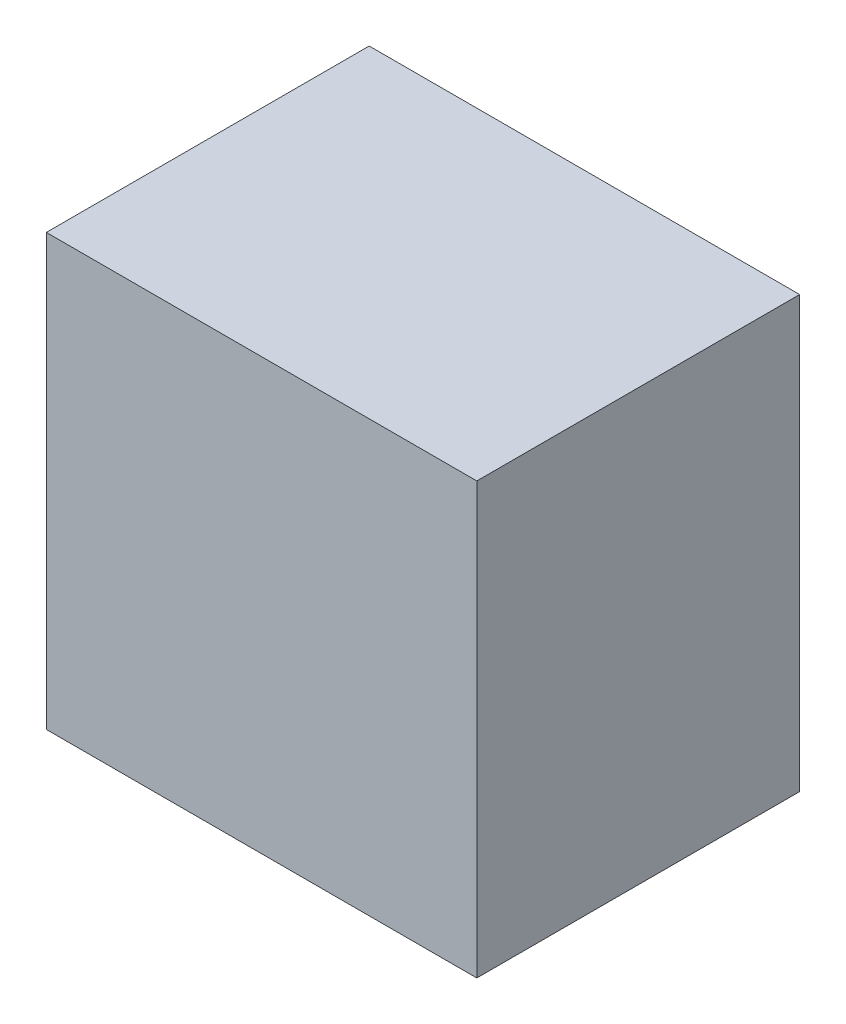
from build123d import *

# Parameters (mm, degrees)
EXTRUDE1_DEPTH = 37.5


with BuildPart() as part:
    # Sketch1 → Extrude1 (new, symmetric)
    with BuildSketch(Plane.XY):
        Polygon((-50, 100), (-50, 0), (50, 0), (50, 100), (0, 100), align=None)
    extrude(amount=EXTRUDE1_DEPTH, both=True)


solid = part.part
